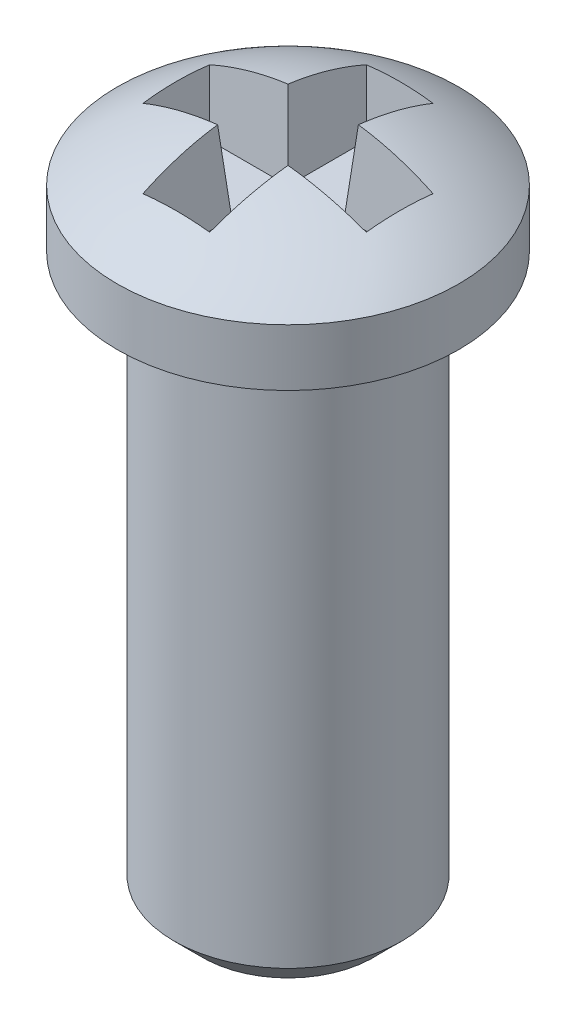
ISO-10303-21;
HEADER;
FILE_DESCRIPTION(('STEP AP214'),'2;1');
FILE_NAME('part.step','',(''),(''),'','','');
FILE_SCHEMA(('AUTOMOTIVE_DESIGN { 1 0 10303 214 1 1 1 1 }'));
ENDSEC;
DATA;
#1=APPLICATION_CONTEXT('core data for automotive mechanical design processes');
#2=APPLICATION_PROTOCOL_DEFINITION('international standard','automotive_design',2000,#1);
#3=PRODUCT_CONTEXT('',#1,'mechanical');
#4=PRODUCT('Part','Part','',(#3));
#5=PRODUCT_RELATED_PRODUCT_CATEGORY('part','',(#4));
#6=PRODUCT_DEFINITION_FORMATION('','',#4);
#7=PRODUCT_DEFINITION_CONTEXT('part definition',#1,'design');
#8=PRODUCT_DEFINITION('design','',#6,#7);
#9=PRODUCT_DEFINITION_SHAPE('','',#8);
#10=(LENGTH_UNIT() NAMED_UNIT(*) SI_UNIT(.MILLI.,.METRE.));
#11=(NAMED_UNIT(*) PLANE_ANGLE_UNIT() SI_UNIT($,.RADIAN.));
#12=(NAMED_UNIT(*) SI_UNIT($,.STERADIAN.) SOLID_ANGLE_UNIT());
#13=UNCERTAINTY_MEASURE_WITH_UNIT(LENGTH_MEASURE(1.E-05),#10,'distance_accuracy_value','');
#14=(GEOMETRIC_REPRESENTATION_CONTEXT(3) GLOBAL_UNCERTAINTY_ASSIGNED_CONTEXT((#13)) GLOBAL_UNIT_ASSIGNED_CONTEXT((#10,
#11,#12)) REPRESENTATION_CONTEXT('',''));
#15=CARTESIAN_POINT('',(0.,0.,0.));
#16=DIRECTION('',(0.,0.,1.));
#17=DIRECTION('',(1.,0.,0.));
#18=AXIS2_PLACEMENT_3D('',#15,#16,#17);
#19=CARTESIAN_POINT('',(0.,0.,0.));
#20=DIRECTION('',(0.,-1.,0.));
#21=DIRECTION('',(0.,0.,-1.));
#22=AXIS2_PLACEMENT_3D('',#19,#20,#21);
#23=PLANE('',#22);
#24=CARTESIAN_POINT('',(0.,0.,0.));
#25=DIRECTION('',(0.,-1.,0.));
#26=DIRECTION('',(0.,0.,-1.));
#27=AXIS2_PLACEMENT_3D('',#24,#25,#26);
#28=CIRCLE('',#27,1.5);
#29=CARTESIAN_POINT('',(0.,0.,-1.5));
#30=VERTEX_POINT('',#29);
#31=EDGE_CURVE('E179',#30,#30,#28,.T.);
#32=ORIENTED_EDGE('',*,*,#31,.T.);
#33=EDGE_LOOP('',(#32));
#34=FACE_BOUND('',#33,.T.);
#35=ADVANCED_FACE('F30',(#34),#23,.T.);
#36=CARTESIAN_POINT('',(0.,0.,0.));
#37=DIRECTION('',(0.,1.,0.));
#38=DIRECTION('',(0.,0.,1.));
#39=AXIS2_PLACEMENT_3D('',#36,#37,#38);
#40=CYLINDRICAL_SURFACE('',#39,2.);
#41=CARTESIAN_POINT('',(0.,0.500000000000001,0.));
#42=DIRECTION('',(0.,-1.,0.));
#43=DIRECTION('',(0.,0.,-1.));
#44=AXIS2_PLACEMENT_3D('',#41,#42,#43);
#45=CIRCLE('',#44,2.);
#46=CARTESIAN_POINT('',(0.,0.500000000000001,-2.));
#47=VERTEX_POINT('',#46);
#48=EDGE_CURVE('E176',#47,#47,#45,.F.);
#49=ORIENTED_EDGE('',*,*,#48,.T.);
#50=EDGE_LOOP('',(#49));
#51=FACE_BOUND('',#50,.T.);
#52=CARTESIAN_POINT('',(0.,10.,0.));
#53=DIRECTION('',(0.,1.,0.));
#54=DIRECTION('',(0.,0.,1.));
#55=AXIS2_PLACEMENT_3D('',#52,#53,#54);
#56=CIRCLE('',#55,2.);
#57=CARTESIAN_POINT('',(0.,10.,2.));
#58=VERTEX_POINT('',#57);
#59=EDGE_CURVE('E173',#58,#58,#56,.T.);
#60=ORIENTED_EDGE('',*,*,#59,.F.);
#61=EDGE_LOOP('',(#60));
#62=FACE_BOUND('',#61,.T.);
#63=ADVANCED_FACE('F276',(#51,#62),#40,.T.);
#64=CARTESIAN_POINT('',(0.,10.,2.));
#65=DIRECTION('',(0.,-1.,0.));
#66=DIRECTION('',(0.,0.,-1.));
#67=AXIS2_PLACEMENT_3D('',#64,#65,#66);
#68=PLANE('',#67);
#69=ORIENTED_EDGE('',*,*,#59,.T.);
#70=EDGE_LOOP('',(#69));
#71=FACE_BOUND('',#70,.T.);
#72=CARTESIAN_POINT('',(0.,10.,0.));
#73=DIRECTION('',(0.,1.,0.));
#74=DIRECTION('',(0.,0.,1.));
#75=AXIS2_PLACEMENT_3D('',#72,#73,#74);
#76=CIRCLE('',#75,3.);
#77=CARTESIAN_POINT('',(0.,10.,3.));
#78=VERTEX_POINT('',#77);
#79=EDGE_CURVE('E170',#78,#78,#76,.T.);
#80=ORIENTED_EDGE('',*,*,#79,.F.);
#81=EDGE_LOOP('',(#80));
#82=FACE_BOUND('',#81,.T.);
#83=ADVANCED_FACE('F281',(#71,#82),#68,.T.);
#84=CARTESIAN_POINT('',(0.,0.,0.));
#85=DIRECTION('',(0.,1.,0.));
#86=DIRECTION('',(0.,0.,1.));
#87=AXIS2_PLACEMENT_3D('',#84,#85,#86);
#88=CYLINDRICAL_SURFACE('',#87,3.);
#89=ORIENTED_EDGE('',*,*,#79,.T.);
#90=EDGE_LOOP('',(#89));
#91=FACE_BOUND('',#90,.T.);
#92=CARTESIAN_POINT('',(0.,11.,0.));
#93=DIRECTION('',(0.,1.,0.));
#94=DIRECTION('',(0.,0.,1.));
#95=AXIS2_PLACEMENT_3D('',#92,#93,#94);
#96=CIRCLE('',#95,3.);
#97=CARTESIAN_POINT('',(0.,11.,3.));
#98=VERTEX_POINT('',#97);
#99=EDGE_CURVE('E123',#98,#98,#96,.T.);
#100=ORIENTED_EDGE('',*,*,#99,.F.);
#101=EDGE_LOOP('',(#100));
#102=FACE_BOUND('',#101,.T.);
#103=ADVANCED_FACE('F287',(#91,#102),#88,.T.);
#104=CARTESIAN_POINT('',(0.,7.,0.));
#105=DIRECTION('',(0.,1.,0.));
#106=DIRECTION('',(0.,0.,1.));
#107=AXIS2_PLACEMENT_3D('',#104,#105,#106);
#108=SPHERICAL_SURFACE('',#107,5.);
#109=CARTESIAN_POINT('',(-0.186131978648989,6.98371556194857,0.));
#110=DIRECTION('',(-0.996194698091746,-0.0871557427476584,0.));
#111=DIRECTION('',(0.0871557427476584,-0.996194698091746,0.));
#112=AXIS2_PLACEMENT_3D('',#109,#110,#111);
#113=CIRCLE('',#112,4.99650775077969);
#114=CARTESIAN_POINT('',(-0.61825964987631,11.9229574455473,0.618259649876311));
#115=VERTEX_POINT('',#114);
#116=CARTESIAN_POINT('',(-0.586641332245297,11.5615584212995,1.9616413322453));
#117=VERTEX_POINT('',#116);
#118=EDGE_CURVE('E11',#115,#117,#113,.F.);
#119=ORIENTED_EDGE('',*,*,#118,.F.);
#120=CARTESIAN_POINT('',(0.,6.98371556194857,0.186131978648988));
#121=DIRECTION('',(0.,-0.0871557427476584,0.996194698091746));
#122=DIRECTION('',(0.,-0.996194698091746,-0.0871557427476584));
#123=AXIS2_PLACEMENT_3D('',#120,#121,#122);
#124=CIRCLE('',#123,4.99650775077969);
#125=CARTESIAN_POINT('',(-1.9616413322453,11.5615584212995,0.586641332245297));
#126=VERTEX_POINT('',#125);
#127=EDGE_CURVE('E38',#126,#115,#124,.F.);
#128=ORIENTED_EDGE('',*,*,#127,.F.);
#129=CARTESIAN_POINT('',(-1.55068730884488,6.86433243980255,0.));
#130=DIRECTION('',(-0.996194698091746,-0.0871557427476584,0.));
#131=DIRECTION('',(0.0871557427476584,-0.996194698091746,0.));
#132=AXIS2_PLACEMENT_3D('',#129,#130,#131);
#133=CIRCLE('',#132,4.75152219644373);
#134=CARTESIAN_POINT('',(-1.9616413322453,11.5615584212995,-0.586641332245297));
#135=VERTEX_POINT('',#134);
#136=EDGE_CURVE('E200',#135,#126,#133,.F.);
#137=ORIENTED_EDGE('',*,*,#136,.F.);
#138=CARTESIAN_POINT('',(0.,6.98371556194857,-0.186131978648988));
#139=DIRECTION('',(0.,-0.0871557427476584,-0.996194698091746));
#140=DIRECTION('',(0.,0.996194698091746,-0.0871557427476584));
#141=AXIS2_PLACEMENT_3D('',#138,#139,#140);
#142=CIRCLE('',#141,4.99650775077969);
#143=CARTESIAN_POINT('',(-0.618259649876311,11.9229574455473,-0.61825964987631));
#144=VERTEX_POINT('',#143);
#145=EDGE_CURVE('E198',#144,#135,#142,.F.);
#146=ORIENTED_EDGE('',*,*,#145,.F.);
#147=CARTESIAN_POINT('',(-0.186131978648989,6.98371556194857,0.));
#148=DIRECTION('',(-0.996194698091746,-0.0871557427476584,0.));
#149=DIRECTION('',(0.0871557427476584,-0.996194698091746,0.));
#150=AXIS2_PLACEMENT_3D('',#147,#148,#149);
#151=CIRCLE('',#150,4.99650775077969);
#152=CARTESIAN_POINT('',(-0.586641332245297,11.5615584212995,-1.9616413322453));
#153=VERTEX_POINT('',#152);
#154=EDGE_CURVE('E196',#153,#144,#151,.F.);
#155=ORIENTED_EDGE('',*,*,#154,.F.);
#156=CARTESIAN_POINT('',(0.,6.86433243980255,-1.55068730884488));
#157=DIRECTION('',(0.,-0.0871557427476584,-0.996194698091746));
#158=DIRECTION('',(0.,0.996194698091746,-0.0871557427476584));
#159=AXIS2_PLACEMENT_3D('',#156,#157,#158);
#160=CIRCLE('',#159,4.75152219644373);
#161=CARTESIAN_POINT('',(0.586641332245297,11.5615584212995,-1.9616413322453));
#162=VERTEX_POINT('',#161);
#163=EDGE_CURVE('E194',#162,#153,#160,.F.);
#164=ORIENTED_EDGE('',*,*,#163,.F.);
#165=CARTESIAN_POINT('',(0.186131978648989,6.98371556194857,0.));
#166=DIRECTION('',(0.996194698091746,-0.0871557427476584,0.));
#167=DIRECTION('',(0.0871557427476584,0.996194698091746,0.));
#168=AXIS2_PLACEMENT_3D('',#165,#166,#167);
#169=CIRCLE('',#168,4.99650775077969);
#170=CARTESIAN_POINT('',(0.61825964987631,11.9229574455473,-0.618259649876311));
#171=VERTEX_POINT('',#170);
#172=EDGE_CURVE('E192',#171,#162,#169,.F.);
#173=ORIENTED_EDGE('',*,*,#172,.F.);
#174=CARTESIAN_POINT('',(0.,6.98371556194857,-0.186131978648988));
#175=DIRECTION('',(0.,-0.0871557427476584,-0.996194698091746));
#176=DIRECTION('',(0.,0.996194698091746,-0.0871557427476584));
#177=AXIS2_PLACEMENT_3D('',#174,#175,#176);
#178=CIRCLE('',#177,4.99650775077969);
#179=CARTESIAN_POINT('',(1.9616413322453,11.5615584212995,-0.586641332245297));
#180=VERTEX_POINT('',#179);
#181=EDGE_CURVE('E190',#180,#171,#178,.F.);
#182=ORIENTED_EDGE('',*,*,#181,.F.);
#183=CARTESIAN_POINT('',(1.55068730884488,6.86433243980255,0.));
#184=DIRECTION('',(0.996194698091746,-0.0871557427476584,0.));
#185=DIRECTION('',(0.0871557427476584,0.996194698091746,0.));
#186=AXIS2_PLACEMENT_3D('',#183,#184,#185);
#187=CIRCLE('',#186,4.75152219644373);
#188=CARTESIAN_POINT('',(1.9616413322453,11.5615584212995,0.586641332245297));
#189=VERTEX_POINT('',#188);
#190=EDGE_CURVE('E188',#189,#180,#187,.F.);
#191=ORIENTED_EDGE('',*,*,#190,.F.);
#192=CARTESIAN_POINT('',(0.,6.98371556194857,0.186131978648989));
#193=DIRECTION('',(0.,-0.0871557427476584,0.996194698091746));
#194=DIRECTION('',(0.,-0.996194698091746,-0.0871557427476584));
#195=AXIS2_PLACEMENT_3D('',#192,#193,#194);
#196=CIRCLE('',#195,4.99650775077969);
#197=CARTESIAN_POINT('',(0.618259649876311,11.9229574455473,0.618259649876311));
#198=VERTEX_POINT('',#197);
#199=EDGE_CURVE('E186',#198,#189,#196,.F.);
#200=ORIENTED_EDGE('',*,*,#199,.F.);
#201=CARTESIAN_POINT('',(0.186131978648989,6.98371556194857,0.));
#202=DIRECTION('',(0.996194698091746,-0.0871557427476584,0.));
#203=DIRECTION('',(0.0871557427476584,0.996194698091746,0.));
#204=AXIS2_PLACEMENT_3D('',#201,#202,#203);
#205=CIRCLE('',#204,4.99650775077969);
#206=CARTESIAN_POINT('',(0.586641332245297,11.5615584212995,1.9616413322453));
#207=VERTEX_POINT('',#206);
#208=EDGE_CURVE('E184',#207,#198,#205,.F.);
#209=ORIENTED_EDGE('',*,*,#208,.F.);
#210=CARTESIAN_POINT('',(0.,6.86433243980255,1.55068730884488));
#211=DIRECTION('',(0.,-0.0871557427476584,0.996194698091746));
#212=DIRECTION('',(0.,-0.996194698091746,-0.0871557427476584));
#213=AXIS2_PLACEMENT_3D('',#210,#211,#212);
#214=CIRCLE('',#213,4.75152219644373);
#215=EDGE_CURVE('E182',#117,#207,#214,.F.);
#216=ORIENTED_EDGE('',*,*,#215,.F.);
#217=EDGE_LOOP('',(#119,#128,#137,#146,#155,#164,#173,#182,#191,#200,#209,#216));
#218=FACE_BOUND('',#217,.T.);
#219=ORIENTED_EDGE('',*,*,#99,.T.);
#220=EDGE_LOOP('',(#219));
#221=FACE_BOUND('',#220,.T.);
#222=ADVANCED_FACE('F208',(#218,#221),#108,.T.);
#223=CARTESIAN_POINT('',(0.,0.500000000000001,0.));
#224=DIRECTION('',(0.,1.,0.));
#225=DIRECTION('',(0.,0.,1.));
#226=AXIS2_PLACEMENT_3D('',#223,#224,#225);
#227=CONICAL_SURFACE('',#226,2.,0.78539816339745);
#228=ORIENTED_EDGE('',*,*,#31,.F.);
#229=EDGE_LOOP('',(#228));
#230=FACE_BOUND('',#229,.T.);
#231=ORIENTED_EDGE('',*,*,#48,.F.);
#232=EDGE_LOOP('',(#231));
#233=FACE_BOUND('',#232,.T.);
#234=ADVANCED_FACE('F32',(#230,#233),#227,.T.);
#235=CARTESIAN_POINT('',(-0.625,12.,2.));
#236=DIRECTION('',(-0.996194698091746,-0.0871557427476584,0.));
#237=DIRECTION('',(0.0871557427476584,-0.996194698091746,0.));
#238=AXIS2_PLACEMENT_3D('',#235,#236,#237);
#239=PLANE('',#238);
#240=ORIENTED_EDGE('',*,*,#118,.T.);
#241=DIRECTION('',(-0.0868265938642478,0.992432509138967,0.0868265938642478));
#242=VECTOR('',#241,1.);
#243=CARTESIAN_POINT('',(-0.625,12.,2.));
#244=LINE('',#243,#242);
#245=CARTESIAN_POINT('',(-0.493767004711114,10.5,1.86876700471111));
#246=VERTEX_POINT('',#245);
#247=EDGE_CURVE('E45',#246,#117,#244,.T.);
#248=ORIENTED_EDGE('',*,*,#247,.F.);
#249=DIRECTION('',(0.,0.,1.));
#250=VECTOR('',#249,1.);
#251=CARTESIAN_POINT('',(-0.493767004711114,10.5,0.625));
#252=LINE('',#251,#250);
#253=CARTESIAN_POINT('',(-0.493767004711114,10.5,0.493767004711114));
#254=VERTEX_POINT('',#253);
#255=EDGE_CURVE('E127',#254,#246,#252,.T.);
#256=ORIENTED_EDGE('',*,*,#255,.F.);
#257=DIRECTION('',(-0.0868265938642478,0.992432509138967,0.0868265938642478));
#258=VECTOR('',#257,1.);
#259=CARTESIAN_POINT('',(-0.635365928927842,12.1184831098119,0.635365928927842));
#260=LINE('',#259,#258);
#261=EDGE_CURVE('E116',#254,#115,#260,.T.);
#262=ORIENTED_EDGE('',*,*,#261,.T.);
#263=EDGE_LOOP('',(#240,#248,#256,#262));
#264=FACE_BOUND('',#263,.T.);
#265=ADVANCED_FACE('F128',(#264),#239,.F.);
#266=CARTESIAN_POINT('',(-0.625,12.,0.625));
#267=DIRECTION('',(0.,-0.0871557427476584,0.996194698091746));
#268=DIRECTION('',(0.,-0.996194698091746,-0.0871557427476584));
#269=AXIS2_PLACEMENT_3D('',#266,#267,#268);
#270=PLANE('',#269);
#271=ORIENTED_EDGE('',*,*,#127,.T.);
#272=ORIENTED_EDGE('',*,*,#261,.F.);
#273=DIRECTION('',(1.,0.,0.));
#274=VECTOR('',#273,1.);
#275=CARTESIAN_POINT('',(-0.625,10.5,0.493767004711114));
#276=LINE('',#275,#274);
#277=CARTESIAN_POINT('',(-1.86876700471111,10.5,0.493767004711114));
#278=VERTEX_POINT('',#277);
#279=EDGE_CURVE('E120',#278,#254,#276,.T.);
#280=ORIENTED_EDGE('',*,*,#279,.F.);
#281=DIRECTION('',(-0.0868265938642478,0.992432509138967,0.0868265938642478));
#282=VECTOR('',#281,1.);
#283=CARTESIAN_POINT('',(-1.99057642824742,11.8922880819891,0.615576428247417));
#284=LINE('',#283,#282);
#285=EDGE_CURVE('E124',#278,#126,#284,.T.);
#286=ORIENTED_EDGE('',*,*,#285,.T.);
#287=EDGE_LOOP('',(#271,#272,#280,#286));
#288=FACE_BOUND('',#287,.T.);
#289=ADVANCED_FACE('F118',(#288),#270,.F.);
#290=CARTESIAN_POINT('',(-2.,12.,-0.625));
#291=DIRECTION('',(-0.996194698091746,-0.0871557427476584,0.));
#292=DIRECTION('',(0.0871557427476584,-0.996194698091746,0.));
#293=AXIS2_PLACEMENT_3D('',#290,#291,#292);
#294=PLANE('',#293);
#295=ORIENTED_EDGE('',*,*,#136,.T.);
#296=ORIENTED_EDGE('',*,*,#285,.F.);
#297=DIRECTION('',(0.,0.,1.));
#298=VECTOR('',#297,1.);
#299=CARTESIAN_POINT('',(-1.86876700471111,10.5,0.625));
#300=LINE('',#299,#298);
#301=CARTESIAN_POINT('',(-1.86876700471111,10.5,-0.493767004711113));
#302=VERTEX_POINT('',#301);
#303=EDGE_CURVE('E137',#302,#278,#300,.T.);
#304=ORIENTED_EDGE('',*,*,#303,.F.);
#305=DIRECTION('',(-0.0868265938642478,0.992432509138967,-0.0868265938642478));
#306=VECTOR('',#305,1.);
#307=CARTESIAN_POINT('',(-2.,12.,-0.625));
#308=LINE('',#307,#306);
#309=EDGE_CURVE('E205',#302,#135,#308,.T.);
#310=ORIENTED_EDGE('',*,*,#309,.T.);
#311=EDGE_LOOP('',(#295,#296,#304,#310));
#312=FACE_BOUND('',#311,.T.);
#313=ADVANCED_FACE('F204',(#312),#294,.F.);
#314=CARTESIAN_POINT('',(-2.,12.,-0.625));
#315=DIRECTION('',(0.,-0.0871557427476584,-0.996194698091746));
#316=DIRECTION('',(0.,0.996194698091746,-0.0871557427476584));
#317=AXIS2_PLACEMENT_3D('',#314,#315,#316);
#318=PLANE('',#317);
#319=ORIENTED_EDGE('',*,*,#145,.T.);
#320=ORIENTED_EDGE('',*,*,#309,.F.);
#321=DIRECTION('',(-1.,0.,0.));
#322=VECTOR('',#321,1.);
#323=CARTESIAN_POINT('',(-0.625,10.5,-0.493767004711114));
#324=LINE('',#323,#322);
#325=CARTESIAN_POINT('',(-0.493767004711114,10.5,-0.493767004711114));
#326=VERTEX_POINT('',#325);
#327=EDGE_CURVE('E141',#326,#302,#324,.T.);
#328=ORIENTED_EDGE('',*,*,#327,.F.);
#329=DIRECTION('',(-0.0868265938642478,0.992432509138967,-0.0868265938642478));
#330=VECTOR('',#329,1.);
#331=CARTESIAN_POINT('',(-0.635365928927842,12.1184831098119,-0.635365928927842));
#332=LINE('',#331,#330);
#333=EDGE_CURVE('E238',#326,#144,#332,.T.);
#334=ORIENTED_EDGE('',*,*,#333,.T.);
#335=EDGE_LOOP('',(#319,#320,#328,#334));
#336=FACE_BOUND('',#335,.T.);
#337=ADVANCED_FACE('F243',(#336),#318,.F.);
#338=CARTESIAN_POINT('',(-0.625,12.,-0.625));
#339=DIRECTION('',(-0.996194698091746,-0.0871557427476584,0.));
#340=DIRECTION('',(0.0871557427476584,-0.996194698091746,0.));
#341=AXIS2_PLACEMENT_3D('',#338,#339,#340);
#342=PLANE('',#341);
#343=ORIENTED_EDGE('',*,*,#154,.T.);
#344=ORIENTED_EDGE('',*,*,#333,.F.);
#345=DIRECTION('',(0.,0.,1.));
#346=VECTOR('',#345,1.);
#347=CARTESIAN_POINT('',(-0.493767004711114,10.5,0.625));
#348=LINE('',#347,#346);
#349=CARTESIAN_POINT('',(-0.493767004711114,10.5,-1.86876700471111));
#350=VERTEX_POINT('',#349);
#351=EDGE_CURVE('E146',#350,#326,#348,.T.);
#352=ORIENTED_EDGE('',*,*,#351,.F.);
#353=DIRECTION('',(-0.0868265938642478,0.992432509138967,-0.0868265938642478));
#354=VECTOR('',#353,1.);
#355=CARTESIAN_POINT('',(-0.615576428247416,11.8922880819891,-1.99057642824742));
#356=LINE('',#355,#354);
#357=EDGE_CURVE('E235',#350,#153,#356,.T.);
#358=ORIENTED_EDGE('',*,*,#357,.T.);
#359=EDGE_LOOP('',(#343,#344,#352,#358));
#360=FACE_BOUND('',#359,.T.);
#361=ADVANCED_FACE('F249',(#360),#342,.F.);
#362=CARTESIAN_POINT('',(0.625,12.,-2.));
#363=DIRECTION('',(0.,-0.0871557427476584,-0.996194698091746));
#364=DIRECTION('',(0.,0.996194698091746,-0.0871557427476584));
#365=AXIS2_PLACEMENT_3D('',#362,#363,#364);
#366=PLANE('',#365);
#367=ORIENTED_EDGE('',*,*,#163,.T.);
#368=ORIENTED_EDGE('',*,*,#357,.F.);
#369=DIRECTION('',(-1.,0.,0.));
#370=VECTOR('',#369,1.);
#371=CARTESIAN_POINT('',(-0.625,10.5,-1.86876700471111));
#372=LINE('',#371,#370);
#373=CARTESIAN_POINT('',(0.493767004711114,10.5,-1.86876700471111));
#374=VERTEX_POINT('',#373);
#375=EDGE_CURVE('E149',#374,#350,#372,.T.);
#376=ORIENTED_EDGE('',*,*,#375,.F.);
#377=DIRECTION('',(0.0868265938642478,0.992432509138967,-0.0868265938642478));
#378=VECTOR('',#377,1.);
#379=CARTESIAN_POINT('',(0.625,12.,-2.));
#380=LINE('',#379,#378);
#381=EDGE_CURVE('E232',#374,#162,#380,.T.);
#382=ORIENTED_EDGE('',*,*,#381,.T.);
#383=EDGE_LOOP('',(#367,#368,#376,#382));
#384=FACE_BOUND('',#383,.T.);
#385=ADVANCED_FACE('F252',(#384),#366,.F.);
#386=CARTESIAN_POINT('',(0.625,12.,-2.));
#387=DIRECTION('',(0.996194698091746,-0.0871557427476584,0.));
#388=DIRECTION('',(0.0871557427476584,0.996194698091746,0.));
#389=AXIS2_PLACEMENT_3D('',#386,#387,#388);
#390=PLANE('',#389);
#391=ORIENTED_EDGE('',*,*,#172,.T.);
#392=ORIENTED_EDGE('',*,*,#381,.F.);
#393=DIRECTION('',(0.,0.,-1.));
#394=VECTOR('',#393,1.);
#395=CARTESIAN_POINT('',(0.493767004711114,10.5,0.625));
#396=LINE('',#395,#394);
#397=CARTESIAN_POINT('',(0.493767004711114,10.5,-0.493767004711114));
#398=VERTEX_POINT('',#397);
#399=EDGE_CURVE('E152',#398,#374,#396,.T.);
#400=ORIENTED_EDGE('',*,*,#399,.F.);
#401=DIRECTION('',(0.0868265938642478,0.992432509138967,-0.0868265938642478));
#402=VECTOR('',#401,1.);
#403=CARTESIAN_POINT('',(0.635365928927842,12.1184831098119,-0.635365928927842));
#404=LINE('',#403,#402);
#405=EDGE_CURVE('E229',#398,#171,#404,.T.);
#406=ORIENTED_EDGE('',*,*,#405,.T.);
#407=EDGE_LOOP('',(#391,#392,#400,#406));
#408=FACE_BOUND('',#407,.T.);
#409=ADVANCED_FACE('F255',(#408),#390,.F.);
#410=CARTESIAN_POINT('',(0.625,12.,-0.625));
#411=DIRECTION('',(0.,-0.0871557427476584,-0.996194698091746));
#412=DIRECTION('',(0.,0.996194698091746,-0.0871557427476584));
#413=AXIS2_PLACEMENT_3D('',#410,#411,#412);
#414=PLANE('',#413);
#415=ORIENTED_EDGE('',*,*,#181,.T.);
#416=ORIENTED_EDGE('',*,*,#405,.F.);
#417=DIRECTION('',(-1.,0.,0.));
#418=VECTOR('',#417,1.);
#419=CARTESIAN_POINT('',(-0.625,10.5,-0.493767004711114));
#420=LINE('',#419,#418);
#421=CARTESIAN_POINT('',(1.86876700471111,10.5,-0.493767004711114));
#422=VERTEX_POINT('',#421);
#423=EDGE_CURVE('E155',#422,#398,#420,.T.);
#424=ORIENTED_EDGE('',*,*,#423,.F.);
#425=DIRECTION('',(0.0868265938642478,0.992432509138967,-0.0868265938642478));
#426=VECTOR('',#425,1.);
#427=CARTESIAN_POINT('',(2.,12.,-0.625));
#428=LINE('',#427,#426);
#429=EDGE_CURVE('E226',#422,#180,#428,.T.);
#430=ORIENTED_EDGE('',*,*,#429,.T.);
#431=EDGE_LOOP('',(#415,#416,#424,#430));
#432=FACE_BOUND('',#431,.T.);
#433=ADVANCED_FACE('F259',(#432),#414,.F.);
#434=CARTESIAN_POINT('',(2.,12.,-0.625));
#435=DIRECTION('',(0.996194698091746,-0.0871557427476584,0.));
#436=DIRECTION('',(0.0871557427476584,0.996194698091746,0.));
#437=AXIS2_PLACEMENT_3D('',#434,#435,#436);
#438=PLANE('',#437);
#439=ORIENTED_EDGE('',*,*,#190,.T.);
#440=ORIENTED_EDGE('',*,*,#429,.F.);
#441=DIRECTION('',(0.,0.,-1.));
#442=VECTOR('',#441,1.);
#443=CARTESIAN_POINT('',(1.86876700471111,10.5,0.625));
#444=LINE('',#443,#442);
#445=CARTESIAN_POINT('',(1.86876700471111,10.5,0.493767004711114));
#446=VERTEX_POINT('',#445);
#447=EDGE_CURVE('E158',#446,#422,#444,.T.);
#448=ORIENTED_EDGE('',*,*,#447,.F.);
#449=DIRECTION('',(0.0868265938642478,0.992432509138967,0.0868265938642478));
#450=VECTOR('',#449,1.);
#451=CARTESIAN_POINT('',(2.,12.,0.625));
#452=LINE('',#451,#450);
#453=EDGE_CURVE('E221',#446,#189,#452,.T.);
#454=ORIENTED_EDGE('',*,*,#453,.T.);
#455=EDGE_LOOP('',(#439,#440,#448,#454));
#456=FACE_BOUND('',#455,.T.);
#457=ADVANCED_FACE('F263',(#456),#438,.F.);
#458=CARTESIAN_POINT('',(2.,12.,0.625));
#459=DIRECTION('',(0.,-0.0871557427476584,0.996194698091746));
#460=DIRECTION('',(0.,-0.996194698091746,-0.0871557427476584));
#461=AXIS2_PLACEMENT_3D('',#458,#459,#460);
#462=PLANE('',#461);
#463=ORIENTED_EDGE('',*,*,#199,.T.);
#464=ORIENTED_EDGE('',*,*,#453,.F.);
#465=DIRECTION('',(1.,0.,0.));
#466=VECTOR('',#465,1.);
#467=CARTESIAN_POINT('',(-0.625,10.5,0.493767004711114));
#468=LINE('',#467,#466);
#469=CARTESIAN_POINT('',(0.493767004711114,10.5,0.493767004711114));
#470=VERTEX_POINT('',#469);
#471=EDGE_CURVE('E161',#470,#446,#468,.T.);
#472=ORIENTED_EDGE('',*,*,#471,.F.);
#473=DIRECTION('',(0.0868265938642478,0.992432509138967,0.0868265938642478));
#474=VECTOR('',#473,1.);
#475=CARTESIAN_POINT('',(0.635365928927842,12.1184831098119,0.635365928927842));
#476=LINE('',#475,#474);
#477=EDGE_CURVE('E219',#470,#198,#476,.T.);
#478=ORIENTED_EDGE('',*,*,#477,.T.);
#479=EDGE_LOOP('',(#463,#464,#472,#478));
#480=FACE_BOUND('',#479,.T.);
#481=ADVANCED_FACE('F266',(#480),#462,.F.);
#482=CARTESIAN_POINT('',(0.625,12.,0.625));
#483=DIRECTION('',(0.996194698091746,-0.0871557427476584,0.));
#484=DIRECTION('',(0.0871557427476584,0.996194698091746,0.));
#485=AXIS2_PLACEMENT_3D('',#482,#483,#484);
#486=PLANE('',#485);
#487=ORIENTED_EDGE('',*,*,#208,.T.);
#488=ORIENTED_EDGE('',*,*,#477,.F.);
#489=DIRECTION('',(0.,0.,-1.));
#490=VECTOR('',#489,1.);
#491=CARTESIAN_POINT('',(0.493767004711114,10.5,0.625));
#492=LINE('',#491,#490);
#493=CARTESIAN_POINT('',(0.493767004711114,10.5,1.86876700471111));
#494=VERTEX_POINT('',#493);
#495=EDGE_CURVE('E164',#494,#470,#492,.T.);
#496=ORIENTED_EDGE('',*,*,#495,.F.);
#497=DIRECTION('',(0.0868265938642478,0.992432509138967,0.0868265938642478));
#498=VECTOR('',#497,1.);
#499=CARTESIAN_POINT('',(0.625,12.,2.));
#500=LINE('',#499,#498);
#501=EDGE_CURVE('E139',#494,#207,#500,.T.);
#502=ORIENTED_EDGE('',*,*,#501,.T.);
#503=EDGE_LOOP('',(#487,#488,#496,#502));
#504=FACE_BOUND('',#503,.T.);
#505=ADVANCED_FACE('F217',(#504),#486,.F.);
#506=CARTESIAN_POINT('',(0.625,12.,2.));
#507=DIRECTION('',(0.,-0.0871557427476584,0.996194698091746));
#508=DIRECTION('',(0.,-0.996194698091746,-0.0871557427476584));
#509=AXIS2_PLACEMENT_3D('',#506,#507,#508);
#510=PLANE('',#509);
#511=ORIENTED_EDGE('',*,*,#215,.T.);
#512=ORIENTED_EDGE('',*,*,#501,.F.);
#513=DIRECTION('',(1.,0.,0.));
#514=VECTOR('',#513,1.);
#515=CARTESIAN_POINT('',(-0.625,10.5,1.86876700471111));
#516=LINE('',#515,#514);
#517=EDGE_CURVE('E131',#246,#494,#516,.T.);
#518=ORIENTED_EDGE('',*,*,#517,.F.);
#519=ORIENTED_EDGE('',*,*,#247,.T.);
#520=EDGE_LOOP('',(#511,#512,#518,#519));
#521=FACE_BOUND('',#520,.T.);
#522=ADVANCED_FACE('F214',(#521),#510,.F.);
#523=CARTESIAN_POINT('',(-0.625,10.5,0.625));
#524=DIRECTION('',(0.,1.,0.));
#525=DIRECTION('',(0.,0.,1.));
#526=AXIS2_PLACEMENT_3D('',#523,#524,#525);
#527=PLANE('',#526);
#528=ORIENTED_EDGE('',*,*,#255,.T.);
#529=ORIENTED_EDGE('',*,*,#517,.T.);
#530=ORIENTED_EDGE('',*,*,#495,.T.);
#531=ORIENTED_EDGE('',*,*,#471,.T.);
#532=ORIENTED_EDGE('',*,*,#447,.T.);
#533=ORIENTED_EDGE('',*,*,#423,.T.);
#534=ORIENTED_EDGE('',*,*,#399,.T.);
#535=ORIENTED_EDGE('',*,*,#375,.T.);
#536=ORIENTED_EDGE('',*,*,#351,.T.);
#537=ORIENTED_EDGE('',*,*,#327,.T.);
#538=ORIENTED_EDGE('',*,*,#303,.T.);
#539=ORIENTED_EDGE('',*,*,#279,.T.);
#540=EDGE_LOOP('',(#528,#529,#530,#531,#532,#533,#534,#535,#536,#537,#538,#539));
#541=FACE_BOUND('',#540,.T.);
#542=ADVANCED_FACE('F134',(#541),#527,.T.);
#543=CLOSED_SHELL('',(#35,#63,#83,#103,#222,#234,#265,#289,#313,#337,#361,#385,#409,#433,#457,
#481,#505,#522,#542));
#544=MANIFOLD_SOLID_BREP('B2',#543);
#545=ADVANCED_BREP_SHAPE_REPRESENTATION('',(#18,#544),#14);
#546=SHAPE_DEFINITION_REPRESENTATION(#9,#545);
ENDSEC;
END-ISO-10303-21;
